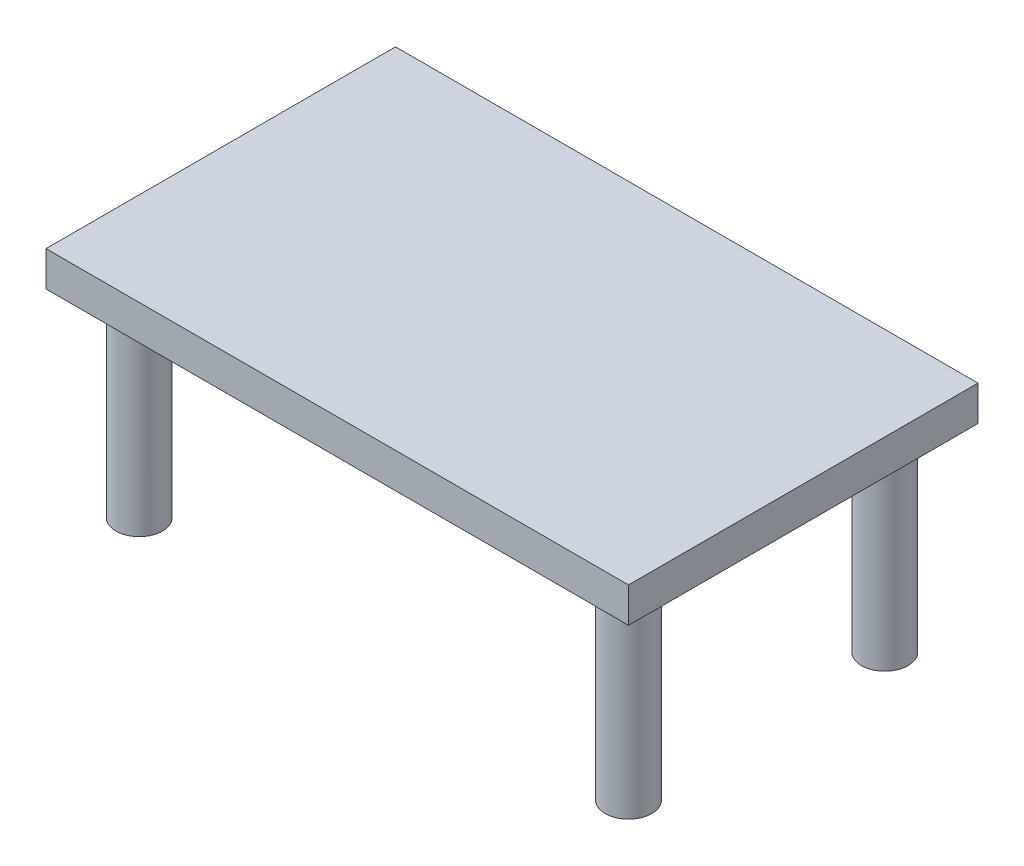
from build123d import *

# Parameters (mm, degrees)
SKETCH_1_W               = 500
SKETCH_1_H               = 300
EXTRUDE_1_DEPTH          = 30
SKETCH_2_R               = 20
EXTRUDE_2_DEPTH          = 170
MIRROR_2_COPY_1_SKETCH_R = 20
MIRROR_2_COPY_1_DEPTH    = 170


with BuildPart() as part:
    # Sketch 1 → Extrude 1 (new body)
    with BuildSketch(Plane(origin=(0, 200, 0), x_dir=(-1, 0, 0), z_dir=(0, 1, 0))):
        Rectangle(SKETCH_1_W, SKETCH_1_H)
    extrude(amount=-EXTRUDE_1_DEPTH)

    # Sketch 2 → Extrude 2 (add)
    with BuildSketch(Plane.XZ.offset(-170)):
        with Locations(Location((-210, 110, 0), (0, 0, 90))):
            Circle(SKETCH_2_R)
    extrude_2 = extrude(amount=EXTRUDE_2_DEPTH)

    # Mirror 1: Extrude 2 across plane
    add(extrude_2.mirror(Plane(origin=(0, 0, 0), x_dir=(0, 0, 1), z_dir=(1, 0, 0))))

    # Mirror 2: Extrude 2 across plane
    add(extrude_2.mirror(Plane.XY))

    # Mirror 2 copy 1 sketch → Mirror 2 copy 1 (add)
    with BuildSketch(Plane(origin=(0, 170, 0), x_dir=(-1, 0, 0), z_dir=(0, -1, 0))):
        with Locations(Location((-210, 110, 0), (0, 0, 90))):
            Circle(MIRROR_2_COPY_1_SKETCH_R)
    extrude(amount=MIRROR_2_COPY_1_DEPTH)


solid = part.part
